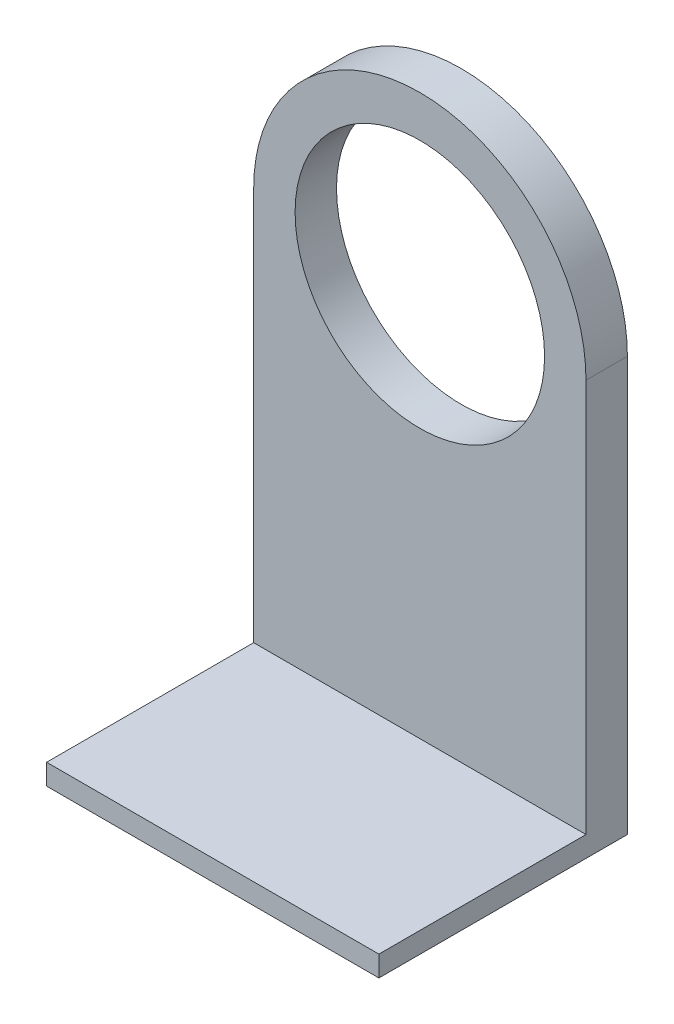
from build123d import *

# Parameters (mm, degrees)
SKETCH1_R      = 38.25
EXTRUDE1_DEPTH = 12.7
SKETCH2_W      = 101.9
SKETCH2_H      = 6.35
EXTRUDE2_DEPTH = 63.5


with BuildPart() as part:
    # Sketch1 → Extrude1 (new body)
    with BuildSketch(Plane.XY):
        with BuildLine():
            Line((50.95, 0), (50.95, -127))
            Line((50.95, -127), (-50.95, -127))
            Line((-50.95, -127), (-50.95, 0))
            ThreePointArc((-50.95, 0), (0, 50.95), (50.95, 0))
        make_face()
        Circle(SKETCH1_R, mode=Mode.SUBTRACT)
    extrude(amount=EXTRUDE1_DEPTH)

    # Sketch2 → Extrude2 (add)
    with BuildSketch(Plane.XY.offset(12.7)):
        with Locations((0, -123.825)):
            Rectangle(SKETCH2_W, SKETCH2_H)
    extrude(amount=EXTRUDE2_DEPTH)


solid = part.part
